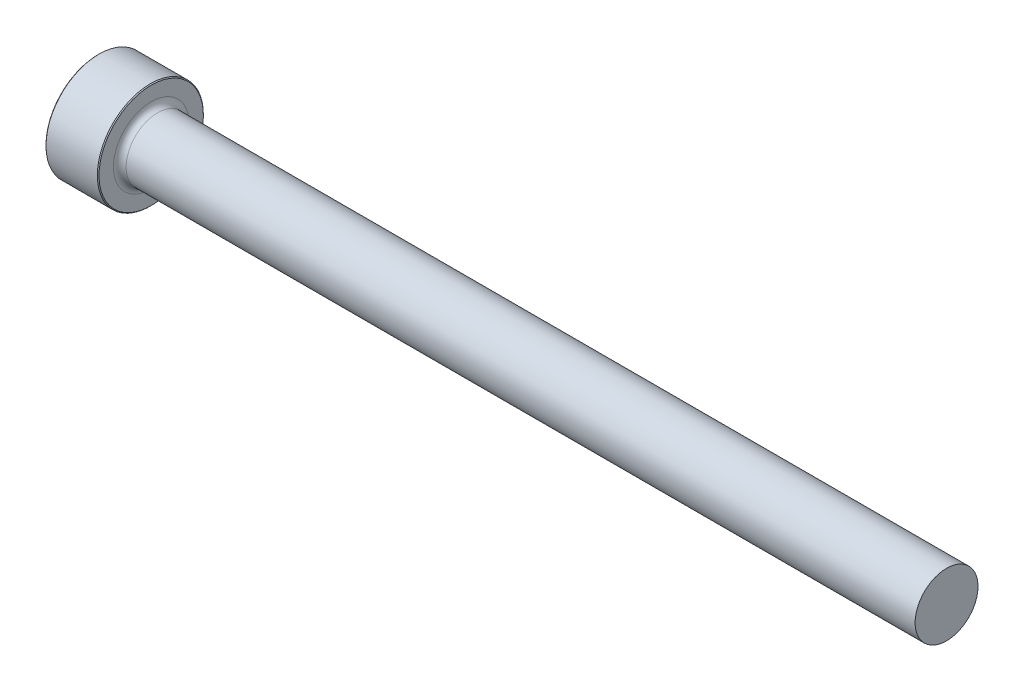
from build123d import *

# Parameters (mm, degrees)
CHAMFER1_SIZE = 0.1016


with BuildPart() as part:
    # Sketch1 → Revolve1 (revolve)
    with BuildSketch(Plane.XY):
        with BuildLine():
            Line((0, 0), (0, 6.35))
            Line((0, 6.35), (6.35, 6.35))
            Line((6.35, 6.35), (6.35, 4.5285025))
            ThreePointArc((6.35, 4.5285025), (6.573184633, 3.989687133), (7.112, 3.7665025))
            Line((7.112, 3.7665025), (101.6, 3.7665025))
            Line((101.6, 3.7665025), (101.6, 0))
            Line((101.6, 0), (0, 0))
        make_face()
    revolve(axis=Axis((101.6, 0, 0), (-1, 0, 0)))

    # Chamfer1
    chamfer1_edges = [part.edges().sort_by_distance(p)[0] for p in [
        (0, -6.35, 0),
        (6.35, -6.35, 0),
    ]]
    chamfer(chamfer1_edges, length=CHAMFER1_SIZE)


solid = part.part
